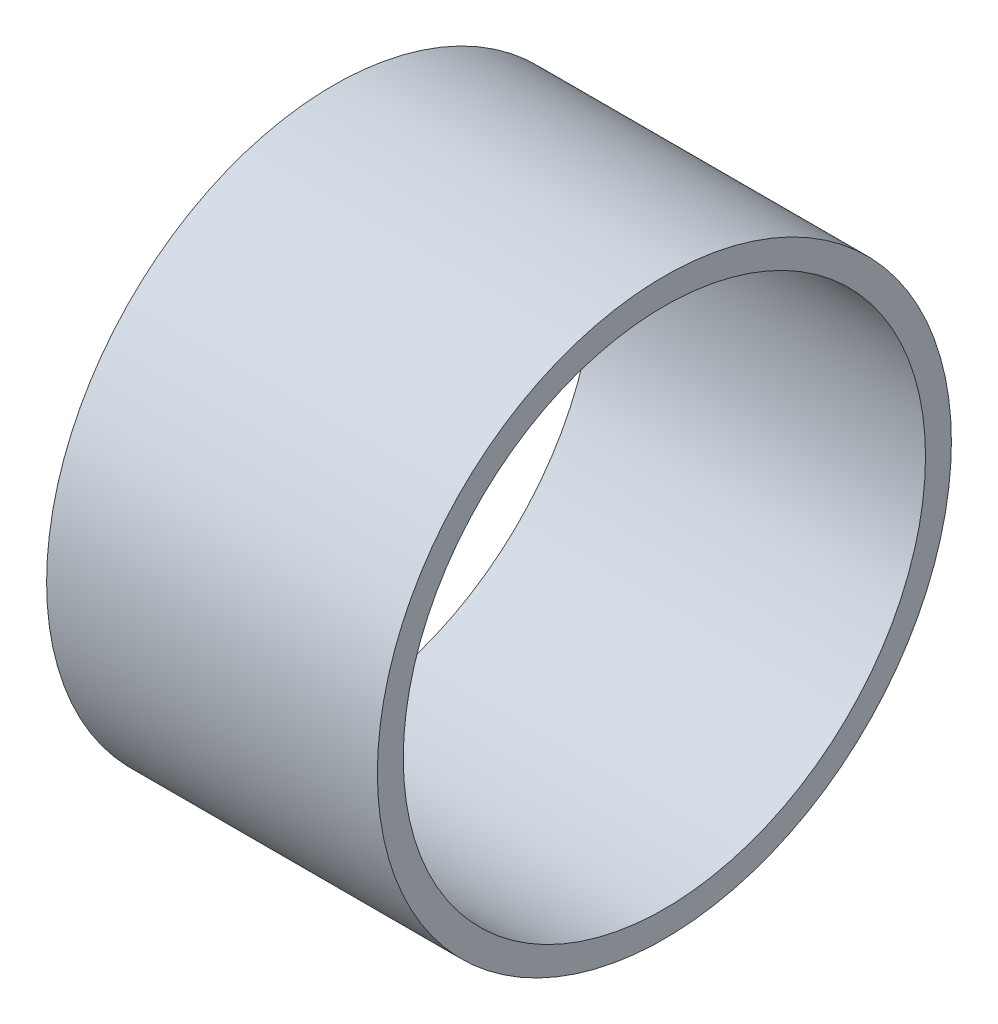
ISO-10303-21;
HEADER;
FILE_DESCRIPTION(('STEP AP214'),'2;1');
FILE_NAME('part.step','',(''),(''),'','','');
FILE_SCHEMA(('AUTOMOTIVE_DESIGN { 1 0 10303 214 1 1 1 1 }'));
ENDSEC;
DATA;
#1=APPLICATION_CONTEXT('core data for automotive mechanical design processes');
#2=APPLICATION_PROTOCOL_DEFINITION('international standard','automotive_design',2000,#1);
#3=PRODUCT_CONTEXT('',#1,'mechanical');
#4=PRODUCT('Part','Part','',(#3));
#5=PRODUCT_RELATED_PRODUCT_CATEGORY('part','',(#4));
#6=PRODUCT_DEFINITION_FORMATION('','',#4);
#7=PRODUCT_DEFINITION_CONTEXT('part definition',#1,'design');
#8=PRODUCT_DEFINITION('design','',#6,#7);
#9=PRODUCT_DEFINITION_SHAPE('','',#8);
#10=(LENGTH_UNIT() NAMED_UNIT(*) SI_UNIT(.MILLI.,.METRE.));
#11=(NAMED_UNIT(*) PLANE_ANGLE_UNIT() SI_UNIT($,.RADIAN.));
#12=(NAMED_UNIT(*) SI_UNIT($,.STERADIAN.) SOLID_ANGLE_UNIT());
#13=UNCERTAINTY_MEASURE_WITH_UNIT(LENGTH_MEASURE(1.E-05),#10,'distance_accuracy_value','');
#14=(GEOMETRIC_REPRESENTATION_CONTEXT(3) GLOBAL_UNCERTAINTY_ASSIGNED_CONTEXT((#13)) GLOBAL_UNIT_ASSIGNED_CONTEXT((#10,
#11,#12)) REPRESENTATION_CONTEXT('',''));
#15=CARTESIAN_POINT('',(0.,0.,0.));
#16=DIRECTION('',(0.,0.,1.));
#17=DIRECTION('',(1.,0.,0.));
#18=AXIS2_PLACEMENT_3D('',#15,#16,#17);
#19=CARTESIAN_POINT('',(-979.397366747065,-877.904505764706,1000.));
#20=DIRECTION('',(1.,0.,0.));
#21=DIRECTION('',(0.,0.,-1.));
#22=AXIS2_PLACEMENT_3D('',#19,#20,#21);
#23=CYLINDRICAL_SURFACE('',#22,69.85);
#24=CARTESIAN_POINT('',(-979.397366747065,-877.904505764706,1000.));
#25=DIRECTION('',(1.,0.,0.));
#26=DIRECTION('',(0.,0.,-1.));
#27=AXIS2_PLACEMENT_3D('',#24,#25,#26);
#28=CIRCLE('',#27,69.85);
#29=CARTESIAN_POINT('',(-979.397366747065,-877.904505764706,930.15));
#30=VERTEX_POINT('',#29);
#31=EDGE_CURVE('E11',#30,#30,#28,.T.);
#32=ORIENTED_EDGE('',*,*,#31,.T.);
#33=EDGE_LOOP('',(#32));
#34=FACE_BOUND('',#33,.T.);
#35=CARTESIAN_POINT('',(-898.897366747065,-877.904505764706,1000.));
#36=DIRECTION('',(1.,0.,0.));
#37=DIRECTION('',(0.,0.,-1.));
#38=AXIS2_PLACEMENT_3D('',#35,#36,#37);
#39=CIRCLE('',#38,69.85);
#40=CARTESIAN_POINT('',(-898.897366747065,-877.904505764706,930.15));
#41=VERTEX_POINT('',#40);
#42=EDGE_CURVE('E37',#41,#41,#39,.T.);
#43=ORIENTED_EDGE('',*,*,#42,.F.);
#44=EDGE_LOOP('',(#43));
#45=FACE_BOUND('',#44,.T.);
#46=ADVANCED_FACE('F34',(#34,#45),#23,.T.);
#47=CARTESIAN_POINT('',(-979.397366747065,-877.904505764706,1000.));
#48=DIRECTION('',(1.,0.,0.));
#49=DIRECTION('',(0.,0.,-1.));
#50=AXIS2_PLACEMENT_3D('',#47,#48,#49);
#51=PLANE('',#50);
#52=CARTESIAN_POINT('',(-979.397366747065,-877.904505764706,1000.));
#53=DIRECTION('',(1.,0.,0.));
#54=DIRECTION('',(0.,0.,-1.));
#55=AXIS2_PLACEMENT_3D('',#52,#53,#54);
#56=CIRCLE('',#55,63.55);
#57=CARTESIAN_POINT('',(-979.397366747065,-877.904505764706,936.45));
#58=VERTEX_POINT('',#57);
#59=EDGE_CURVE('E44',#58,#58,#56,.T.);
#60=ORIENTED_EDGE('',*,*,#59,.T.);
#61=EDGE_LOOP('',(#60));
#62=FACE_BOUND('',#61,.T.);
#63=ORIENTED_EDGE('',*,*,#31,.F.);
#64=EDGE_LOOP('',(#63));
#65=FACE_BOUND('',#64,.T.);
#66=ADVANCED_FACE('F52',(#62,#65),#51,.F.);
#67=CARTESIAN_POINT('',(-898.897366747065,-877.904505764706,1000.));
#68=DIRECTION('',(1.,0.,0.));
#69=DIRECTION('',(0.,0.,-1.));
#70=AXIS2_PLACEMENT_3D('',#67,#68,#69);
#71=PLANE('',#70);
#72=CARTESIAN_POINT('',(-898.897366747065,-877.904505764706,1000.));
#73=DIRECTION('',(1.,0.,0.));
#74=DIRECTION('',(0.,0.,-1.));
#75=AXIS2_PLACEMENT_3D('',#72,#73,#74);
#76=CIRCLE('',#75,63.55);
#77=CARTESIAN_POINT('',(-898.897366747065,-877.904505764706,936.45));
#78=VERTEX_POINT('',#77);
#79=EDGE_CURVE('E46',#78,#78,#76,.T.);
#80=ORIENTED_EDGE('',*,*,#79,.F.);
#81=EDGE_LOOP('',(#80));
#82=FACE_BOUND('',#81,.T.);
#83=ORIENTED_EDGE('',*,*,#42,.T.);
#84=EDGE_LOOP('',(#83));
#85=FACE_BOUND('',#84,.T.);
#86=ADVANCED_FACE('F58',(#82,#85),#71,.T.);
#87=CARTESIAN_POINT('',(-979.397366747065,-877.904505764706,1000.));
#88=DIRECTION('',(1.,0.,0.));
#89=DIRECTION('',(0.,0.,-1.));
#90=AXIS2_PLACEMENT_3D('',#87,#88,#89);
#91=CYLINDRICAL_SURFACE('',#90,63.55);
#92=ORIENTED_EDGE('',*,*,#59,.F.);
#93=EDGE_LOOP('',(#92));
#94=FACE_BOUND('',#93,.T.);
#95=ORIENTED_EDGE('',*,*,#79,.T.);
#96=EDGE_LOOP('',(#95));
#97=FACE_BOUND('',#96,.T.);
#98=ADVANCED_FACE('F55',(#94,#97),#91,.F.);
#99=CLOSED_SHELL('',(#46,#66,#86,#98));
#100=MANIFOLD_SOLID_BREP('B2',#99);
#101=ADVANCED_BREP_SHAPE_REPRESENTATION('',(#18,#100),#14);
#102=SHAPE_DEFINITION_REPRESENTATION(#9,#101);
ENDSEC;
END-ISO-10303-21;
